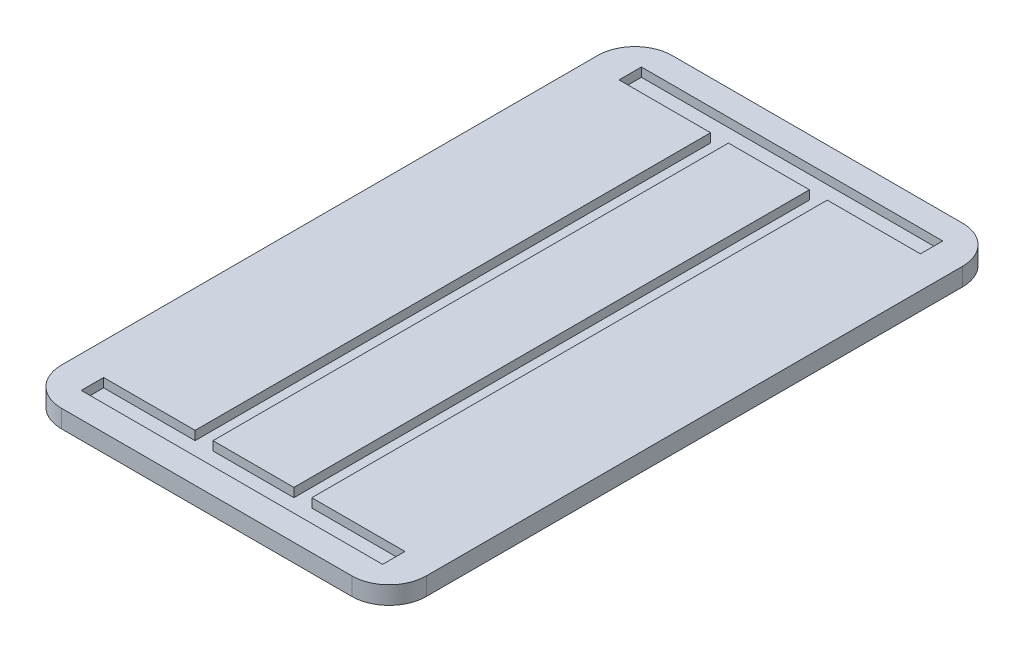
from build123d import *

# Parameters (mm, degrees)
BOSS_EXTRUDE1_DEPTH   = 12
SKETCH1_W             = 54.33
SKETCH1_H             = 346
BOSS_EXTRUDE1_2_DEPTH = 12
SKETCH1_3_W           = 62.52
SKETCH1_3_H           = 15
SKETCH1_3_W_2         = 61.43
SKETCH1_3_W_3         = 54.33
SKETCH1_3_H_2         = 346
BOSS_EXTRUDE2_DEPTH   = 6


with BuildPart() as part:
    # Sketch1 → Boss-Extrude1 (new body)
    with BuildSketch(Plane(origin=(0, 0, 0), x_dir=(1, 0, 0), z_dir=(0, 1, 0))):
        with BuildLine():
            ThreePointArc((122.5, 180), (115.17766953, 197.67766953), (97.5, 205))
            Line((97.5, 205), (-97.5, 205))
            ThreePointArc((-97.5, 205), (-115.17766953, 197.67766953), (-122.5, 180))
            Line((-122.5, 180), (-122.5, -180))
            ThreePointArc((-122.5, -180), (-115.17766953, -197.67766953), (-97.5, -205))
            Line((-97.5, -205), (97.5, -205))
            ThreePointArc((97.5, -205), (115.17766953, -197.67766953), (122.5, -180))
            Line((122.5, -180), (122.5, 180))
        make_face()
        Polygon((101.14, 173), (38.62, 173), (38.62, -173), (101.14, -173), (101.14, -188), (38.62, -188), (32.62, -188), (-33.71, -188), (-39.71, -188), (-101.14, -188), (-101.14, -173), (-39.71, -173), (-39.71, 173), (-101.14, 173), (-101.14, 188), (-39.71, 188), (-33.71, 188), (32.62, 188), (38.62, 188), (101.14, 188), align=None, mode=Mode.SUBTRACT)
    extrude(amount=BOSS_EXTRUDE1_DEPTH)



with BuildPart() as body_2:
    # Sketch1 → Boss-Extrude1 2 (new body)
    with BuildSketch(Plane(origin=(0, 0, 0), x_dir=(1, 0, 0), z_dir=(0, 1, 0))):
        with Locations((-0.545, 0)):
            Rectangle(SKETCH1_W, SKETCH1_H)
    extrude(amount=BOSS_EXTRUDE1_2_DEPTH)


with BuildPart() as part_1:
    add(part.part)

    add(body_2.part)  # Boss-Extrude2 merges body 2
    # Sketch1_3 → Boss-Extrude2 (add)
    # profile 1 of 3: a face of its own
    with BuildSketch(Plane(origin=(0, 0, 0), x_dir=(1, 0, 0), z_dir=(0, 1, 0))):
        with Locations((69.88, 180.5)):
            Rectangle(SKETCH1_3_W, SKETCH1_3_H)
    # profile 2 of 3: a face of its own
    with BuildSketch(Plane(origin=(0, 0, 0), x_dir=(1, 0, 0), z_dir=(0, 1, 0))):
        with Locations((-70.425, 180.5)):
            Rectangle(SKETCH1_3_W_2, SKETCH1_3_H)
    # profile 3 of 3: a face of its own
    with BuildSketch(Plane(origin=(0, 0, 0), x_dir=(1, 0, 0), z_dir=(0, 1, 0))):
        Polygon((-101.14, -173), (-101.14, -188), (-39.71, -188), (-33.71, -188), (32.62, -188), (38.62, -188), (101.14, -188), (101.14, -173), (38.62, -173), (38.62, 173), (38.62, 188), (32.62, 188), (-33.71, 188), (-39.71, 188), (-39.71, 173), (-39.71, -173), align=None)
        with Locations((-0.545, 0)):
            Rectangle(SKETCH1_3_W_3, SKETCH1_3_H_2, mode=Mode.SUBTRACT)
    extrude(amount=BOSS_EXTRUDE2_DEPTH)


solid = part_1.part
